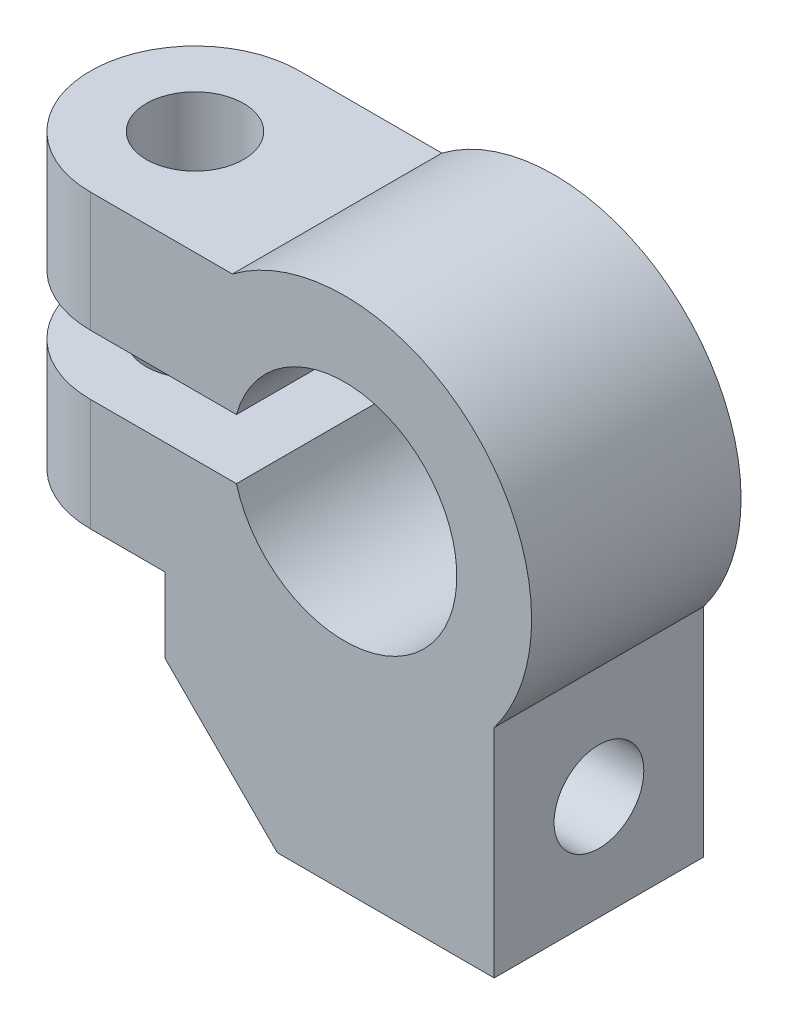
from build123d import *

# Parameters (mm, degrees)
EXTRUSION1_DEPTH                            = 28
ENL_V_MAT_EXTRU_1_DEPTH                     = 85.758480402
ENL_V_MAT_EXTRU_2_DEPTH                     = 71.880180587
DIAM_TRE_DU_PER_AGE_M12_0_12_000000_1_D     = 12
DIAM_TRE_DU_PER_AGE_M12_0_12_000000_1_DEPTH = 18
DIAM_TRE_DU_PER_AGE_M12_0_12_000000_1_TIP   = 3.605163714
DIAM_TRE_DU_PER_AGE_M13_0_13_000000_1_D     = 13


with BuildPart() as part:
    # Esquisse1 → Extrusion1 (new body)
    with BuildSketch(Plane.XY):
        with BuildLine():
            Line((20, -44), (20, -15))
            ThreePointArc((20, -15), (17.67766953, 17.67766953), (-15, 20))
            Line((-15, 20), (-48, 20))
            Line((-48, 20), (-48, -19))
            Line((-48, -19), (-24, -19))
            Line((-24, -19), (-24, -29))
            Line((-24, -29), (-9, -44))
            Line((-9, -44), (20, -44))
        make_face()
    extrude(amount=EXTRUSION1_DEPTH)

    # Esquisse2 → Enl_v. mat.-Extru.1 (cut, through all)
    with BuildSketch(Plane(origin=(0, 20, 0), x_dir=(-1, 0, 0), z_dir=(0, 1, 0))):
        with BuildLine():
            Line((34, 28), (34, 34))
            Line((34, 34), (50, 34))
            Line((50, 34), (50, -6))
            Line((50, -6), (34, -6))
            Line((34, -6), (34, 0))
            ThreePointArc((34, 0), (48, 14), (34, 28))
        make_face()
    extrude(amount=-ENL_V_MAT_EXTRU_1_DEPTH, mode=Mode.SUBTRACT)

    # Esquisse3 → Enl_v. mat.-Extru.2 (cut, through all)
    with BuildSketch(Plane.XY.offset(28)):
        with BuildLine():
            Line((-14.456832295, 4), (-48, 4))
            Line((-48, 4), (-48, -4))
            Line((-48, -4), (-14.456832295, -4))
            ThreePointArc((-14.456832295, -4), (15, 0), (-14.456832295, 4))
        make_face()
    extrude(amount=-ENL_V_MAT_EXTRU_2_DEPTH, mode=Mode.SUBTRACT)

    # Diam_tre du per_age M12.0 _12.000000_1
    with Locations(Plane(origin=(20, -30, 14), x_dir=(0, 1, 0), z_dir=(1, 0, 0))):
        with Locations((0, 0)):
            Hole(DIAM_TRE_DU_PER_AGE_M12_0_12_000000_1_D / 2, depth=DIAM_TRE_DU_PER_AGE_M12_0_12_000000_1_DEPTH)
            with Locations((0, 0, -(DIAM_TRE_DU_PER_AGE_M12_0_12_000000_1_DEPTH + DIAM_TRE_DU_PER_AGE_M12_0_12_000000_1_TIP / 2))):  # 118° drill point
                Cone(0, DIAM_TRE_DU_PER_AGE_M12_0_12_000000_1_D / 2, DIAM_TRE_DU_PER_AGE_M12_0_12_000000_1_TIP, mode=Mode.SUBTRACT)

    # Diam_tre du per_age M13.0 _13.000000_1 (through all)
    with Locations(Plane(origin=(0, 20, 0), x_dir=(-1, 0, 0), z_dir=(0, 1, 0))):
        with Locations((34, 14)):
            Hole(DIAM_TRE_DU_PER_AGE_M13_0_13_000000_1_D / 2)


solid = part.part
